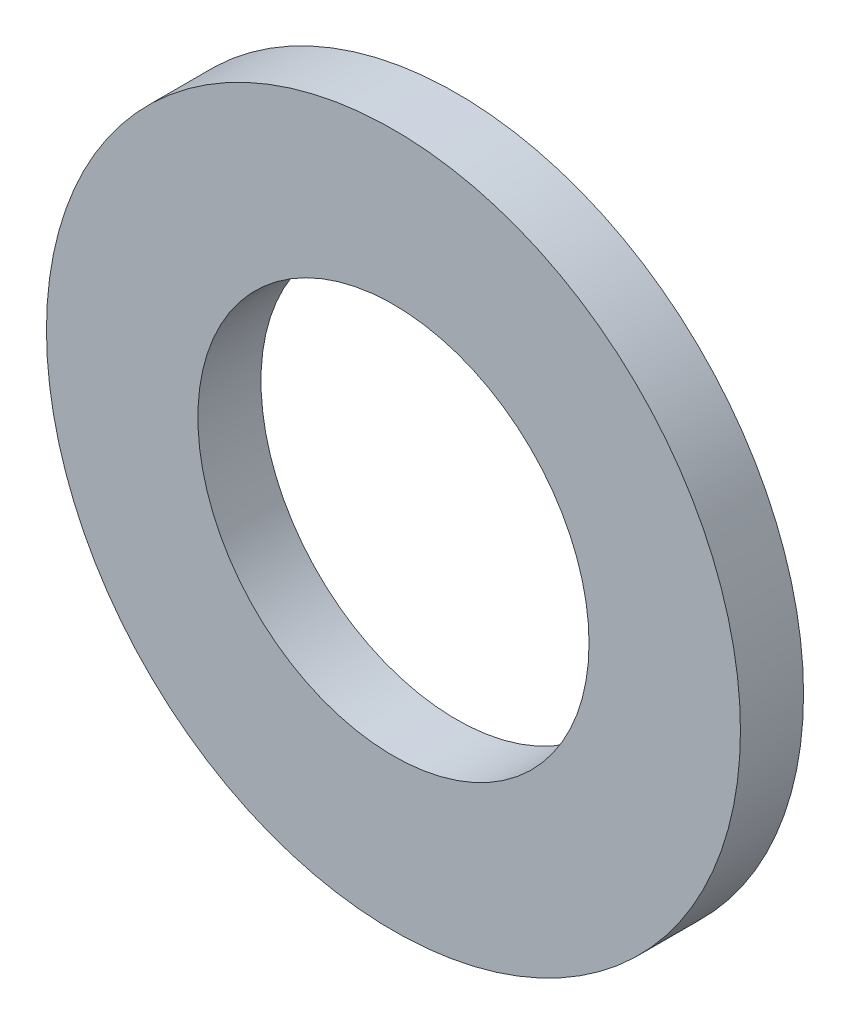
from build123d import *

# Parameters (mm, degrees)
ESQUISSE1_R      = 27.5
ESQUISSE1_R_2    = 15.5
EXTRUSION1_DEPTH = 5


with BuildPart() as part:
    # Esquisse1 → Extrusion1 (new body)
    with BuildSketch(Plane.XY):
        Circle(ESQUISSE1_R)
        Circle(ESQUISSE1_R_2, mode=Mode.SUBTRACT)
    extrude(amount=EXTRUSION1_DEPTH)


solid = part.part
